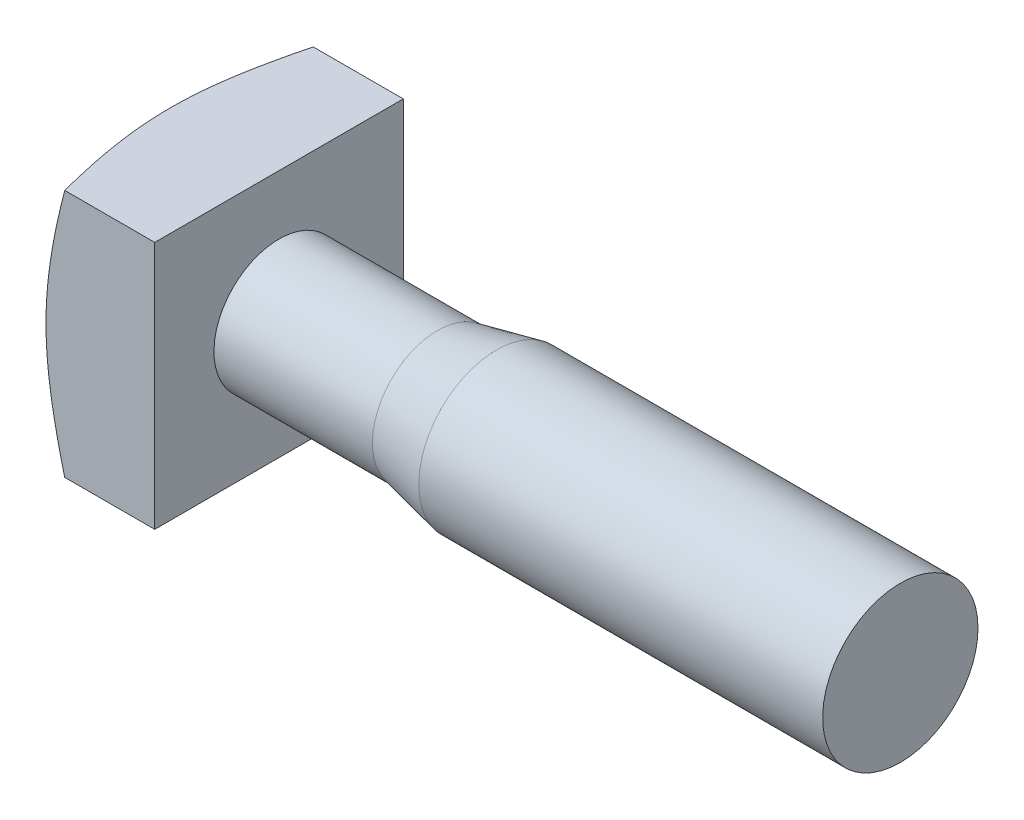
ISO-10303-21;
HEADER;
FILE_DESCRIPTION(('STEP AP214'),'2;1');
FILE_NAME('part.step','',(''),(''),'','','');
FILE_SCHEMA(('AUTOMOTIVE_DESIGN { 1 0 10303 214 1 1 1 1 }'));
ENDSEC;
DATA;
#1=APPLICATION_CONTEXT('core data for automotive mechanical design processes');
#2=APPLICATION_PROTOCOL_DEFINITION('international standard','automotive_design',2000,#1);
#3=PRODUCT_CONTEXT('',#1,'mechanical');
#4=PRODUCT('Part','Part','',(#3));
#5=PRODUCT_RELATED_PRODUCT_CATEGORY('part','',(#4));
#6=PRODUCT_DEFINITION_FORMATION('','',#4);
#7=PRODUCT_DEFINITION_CONTEXT('part definition',#1,'design');
#8=PRODUCT_DEFINITION('design','',#6,#7);
#9=PRODUCT_DEFINITION_SHAPE('','',#8);
#10=(LENGTH_UNIT() NAMED_UNIT(*) SI_UNIT(.MILLI.,.METRE.));
#11=(NAMED_UNIT(*) PLANE_ANGLE_UNIT() SI_UNIT($,.RADIAN.));
#12=(NAMED_UNIT(*) SI_UNIT($,.STERADIAN.) SOLID_ANGLE_UNIT());
#13=UNCERTAINTY_MEASURE_WITH_UNIT(LENGTH_MEASURE(1.E-05),#10,'distance_accuracy_value','');
#14=(GEOMETRIC_REPRESENTATION_CONTEXT(3) GLOBAL_UNCERTAINTY_ASSIGNED_CONTEXT((#13)) GLOBAL_UNIT_ASSIGNED_CONTEXT((#10,
#11,#12)) REPRESENTATION_CONTEXT('',''));
#15=CARTESIAN_POINT('',(0.,0.,0.));
#16=DIRECTION('',(0.,0.,1.));
#17=DIRECTION('',(1.,0.,0.));
#18=AXIS2_PLACEMENT_3D('',#15,#16,#17);
#19=CARTESIAN_POINT('',(7.,-8.,8.00000000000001));
#20=DIRECTION('',(1.,0.,0.));
#21=DIRECTION('',(0.,0.,-1.));
#22=AXIS2_PLACEMENT_3D('',#19,#20,#21);
#23=PLANE('',#22);
#24=DIRECTION('',(0.,-1.,0.));
#25=VECTOR('',#24,1.);
#26=CARTESIAN_POINT('',(7.,8.,8.00000000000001));
#27=LINE('',#26,#25);
#28=CARTESIAN_POINT('',(7.,8.,8.00000000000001));
#29=VERTEX_POINT('',#28);
#30=CARTESIAN_POINT('',(7.,-8.,8.00000000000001));
#31=VERTEX_POINT('',#30);
#32=EDGE_CURVE('E181',#29,#31,#27,.T.);
#33=ORIENTED_EDGE('',*,*,#32,.T.);
#34=DIRECTION('',(0.,0.,-1.));
#35=VECTOR('',#34,1.);
#36=CARTESIAN_POINT('',(7.,-8.,8.00000000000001));
#37=LINE('',#36,#35);
#38=CARTESIAN_POINT('',(7.,-7.99999999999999,-8.00000000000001));
#39=VERTEX_POINT('',#38);
#40=EDGE_CURVE('E184',#31,#39,#37,.T.);
#41=ORIENTED_EDGE('',*,*,#40,.T.);
#42=DIRECTION('',(0.,1.,0.));
#43=VECTOR('',#42,1.);
#44=CARTESIAN_POINT('',(7.,8.00000000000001,-8.));
#45=LINE('',#44,#43);
#46=CARTESIAN_POINT('',(7.,8.00000000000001,-8.));
#47=VERTEX_POINT('',#46);
#48=EDGE_CURVE('E186',#39,#47,#45,.T.);
#49=ORIENTED_EDGE('',*,*,#48,.T.);
#50=DIRECTION('',(0.,0.,1.));
#51=VECTOR('',#50,1.);
#52=CARTESIAN_POINT('',(7.,8.,8.00000000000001));
#53=LINE('',#52,#51);
#54=EDGE_CURVE('E121',#47,#29,#53,.T.);
#55=ORIENTED_EDGE('',*,*,#54,.T.);
#56=EDGE_LOOP('',(#33,#41,#49,#55));
#57=FACE_BOUND('',#56,.T.);
#58=CARTESIAN_POINT('',(7.,0.,0.));
#59=DIRECTION('',(-1.,0.,0.));
#60=DIRECTION('',(0.,-1.,0.));
#61=AXIS2_PLACEMENT_3D('',#58,#59,#60);
#62=CIRCLE('',#61,4.18800000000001);
#63=CARTESIAN_POINT('',(7.,-4.188,0.));
#64=VERTEX_POINT('',#63);
#65=EDGE_CURVE('E300',#64,#64,#62,.T.);
#66=ORIENTED_EDGE('',*,*,#65,.T.);
#67=EDGE_LOOP('',(#66));
#68=FACE_BOUND('',#67,.T.);
#69=ADVANCED_FACE('F43',(#57,#68),#23,.T.);
#70=CARTESIAN_POINT('',(7.,8.,8.00000000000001));
#71=DIRECTION('',(0.,0.,-1.));
#72=DIRECTION('',(-1.,0.,0.));
#73=AXIS2_PLACEMENT_3D('',#70,#71,#72);
#74=PLANE('',#73);
#75=CARTESIAN_POINT('',(3.56376598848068,-15.891278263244,8.00000000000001));
#76=CARTESIAN_POINT('',(3.43024833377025,-15.4805095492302,8.00000000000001));
#77=CARTESIAN_POINT('',(3.29763705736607,-15.069443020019,8.00000000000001));
#78=CARTESIAN_POINT('',(3.03472551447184,-14.246558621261,8.00000000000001));
#79=CARTESIAN_POINT('',(2.9044253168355,-13.8347407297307,8.00000000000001));
#80=CARTESIAN_POINT('',(2.6466844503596,-13.0103574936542,8.00000000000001));
#81=CARTESIAN_POINT('',(2.51924285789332,-12.5977924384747,8.00000000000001));
#82=CARTESIAN_POINT('',(2.26786813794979,-11.7715951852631,8.00000000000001));
#83=CARTESIAN_POINT('',(2.14393498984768,-11.3579629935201,8.00000000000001));
#84=CARTESIAN_POINT('',(1.90156103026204,-10.5330920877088,8.00000000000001));
#85=CARTESIAN_POINT('',(1.78308111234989,-10.1218648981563,8.00000000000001));
#86=CARTESIAN_POINT('',(1.55161025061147,-9.29785965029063,8.00000000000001));
#87=CARTESIAN_POINT('',(1.4386193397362,-8.88508158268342,8.00000000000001));
#88=CARTESIAN_POINT('',(1.21955399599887,-8.05724557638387,8.00000000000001));
#89=CARTESIAN_POINT('',(1.11348653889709,-7.64218578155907,8.00000000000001));
#90=CARTESIAN_POINT('',(0.910418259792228,-6.80983428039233,8.00000000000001));
#91=CARTESIAN_POINT('',(0.813417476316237,-6.39254256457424,8.00000000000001));
#92=CARTESIAN_POINT('',(0.634044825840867,-5.5688726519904,8.00000000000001));
#93=CARTESIAN_POINT('',(0.551302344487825,-5.1625759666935,8.00000000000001));
#94=CARTESIAN_POINT('',(0.399704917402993,-4.34736441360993,8.00000000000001));
#95=CARTESIAN_POINT('',(0.330849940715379,-3.93844955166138,8.00000000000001));
#96=CARTESIAN_POINT('',(0.210494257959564,-3.11893988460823,8.00000000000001));
#97=CARTESIAN_POINT('',(0.158955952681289,-2.70835070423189,8.00000000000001));
#98=CARTESIAN_POINT('',(0.0762837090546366,-1.88510388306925,8.00000000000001));
#99=CARTESIAN_POINT('',(0.0451483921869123,-1.47244638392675,8.00000000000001));
#100=CARTESIAN_POINT('',(0.00554317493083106,-0.643249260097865,8.00000000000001));
#101=CARTESIAN_POINT('',(-0.00277386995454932,-0.226702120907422,8.00000000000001));
#102=CARTESIAN_POINT('',(0.00441153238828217,0.606178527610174,8.00000000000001));
#103=CARTESIAN_POINT('',(0.0199140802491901,1.02251203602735,8.00000000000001));
#104=CARTESIAN_POINT('',(0.0734837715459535,1.85452132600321,8.00000000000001));
#105=CARTESIAN_POINT('',(0.111595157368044,2.27019421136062,8.00000000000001));
#106=CARTESIAN_POINT('',(0.183578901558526,2.89192416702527,8.00000000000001));
#107=CARTESIAN_POINT('',(0.210044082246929,3.09887794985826,8.00000000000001));
#108=CARTESIAN_POINT('',(0.267489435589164,3.51215667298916,8.00000000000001));
#109=CARTESIAN_POINT('',(0.298469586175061,3.71848161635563,8.00000000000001));
#110=CARTESIAN_POINT('',(0.428429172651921,4.52929851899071,8.00000000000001));
#111=CARTESIAN_POINT('',(0.542940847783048,5.13133310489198,8.00000000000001));
#112=CARTESIAN_POINT('',(0.733500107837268,6.03032508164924,8.00000000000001));
#113=CARTESIAN_POINT('',(0.800167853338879,6.32937502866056,8.00000000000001));
#114=CARTESIAN_POINT('',(0.938763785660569,6.92625756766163,8.00000000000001));
#115=CARTESIAN_POINT('',(1.01069185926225,7.22409018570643,8.00000000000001));
#116=CARTESIAN_POINT('',(1.15901277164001,7.81901260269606,8.00000000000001));
#117=CARTESIAN_POINT('',(1.23541086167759,8.11610108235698,8.00000000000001));
#118=CARTESIAN_POINT('',(1.39187536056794,8.70931252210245,8.00000000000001));
#119=CARTESIAN_POINT('',(1.47194181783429,9.00543546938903,8.00000000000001));
#120=CARTESIAN_POINT('',(1.71669014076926,9.89244184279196,8.00000000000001));
#121=CARTESIAN_POINT('',(1.88594624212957,10.482062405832,8.00000000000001));
#122=CARTESIAN_POINT('',(2.2338625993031,11.6613841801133,8.00000000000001));
#123=CARTESIAN_POINT('',(2.41256174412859,12.2510738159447,8.00000000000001));
#124=CARTESIAN_POINT('',(2.77629092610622,13.4285095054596,8.00000000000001));
#125=CARTESIAN_POINT('',(2.96132113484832,14.0162555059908,8.00000000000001));
#126=CARTESIAN_POINT('',(3.33593747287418,15.1898218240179,8.00000000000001));
#127=CARTESIAN_POINT('',(3.52552021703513,15.7756432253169,8.00000000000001));
#128=CARTESIAN_POINT('',(3.90823682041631,16.9461167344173,8.00000000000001));
#129=CARTESIAN_POINT('',(4.1013706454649,17.5307688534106,8.00000000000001));
#130=CARTESIAN_POINT('',(4.4890162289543,18.695050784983,8.00000000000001));
#131=CARTESIAN_POINT('',(4.6835087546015,19.2746870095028,8.00000000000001));
#132=CARTESIAN_POINT('',(5.07463191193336,20.4332380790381,8.00000000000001));
#133=CARTESIAN_POINT('',(5.27126254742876,21.0121529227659,8.00000000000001));
#134=CARTESIAN_POINT('',(5.86378383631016,22.7482864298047,8.00000000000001));
#135=CARTESIAN_POINT('',(6.26221774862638,23.9046368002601,8.00000000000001));
#136=CARTESIAN_POINT('',(7.05987917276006,26.2051158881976,8.00000000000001));
#137=CARTESIAN_POINT('',(7.45906545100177,27.3492589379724,8.00000000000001));
#138=CARTESIAN_POINT('',(8.06012955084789,29.0645171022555,8.00000000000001));
#139=CARTESIAN_POINT('',(8.26084064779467,29.6360414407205,8.00000000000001));
#140=CARTESIAN_POINT('',(8.66292988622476,30.7788547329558,8.00000000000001));
#141=CARTESIAN_POINT('',(8.8643080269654,31.3501436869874,8.00000000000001));
#142=CARTESIAN_POINT('',(9.0659647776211,31.9213342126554,8.00000000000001));
#143=B_SPLINE_CURVE_WITH_KNOTS('',3,(#75,#76,#77,#78,#79,#80,#81,#82,#83,#84,#85,#86,#87,#88,
#89,#90,#91,#92,#93,#94,#95,#96,#97,#98,#99,#100,#101,#102,#103,#104,#105,#106,#107,#108,#109,
#110,#111,#112,#113,#114,#115,#116,#117,#118,#119,#120,#121,#122,#123,#124,#125,#126,#127,#128,
#129,#130,#131,#132,#133,#134,#135,#136,#137,#138,#139,#140,#141,#142),.UNSPECIFIED.,.F.,.F.,(4,
2,2,2,2,2,2,2,2,2,2,2,2,2,2,2,2,2,2,2,2,2,2,2,2,2,2,2,2,2,2,2,2,4),(0.,1.29577397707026,
2.59158649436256,3.88697411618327,5.18235412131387,6.46618892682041,7.75003143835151,
9.03514813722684,10.3202702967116,11.5639904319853,12.8077077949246,14.0487069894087,
15.2896223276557,16.5388302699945,17.7880434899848,19.0397093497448,19.665584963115,
20.2914575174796,22.1289928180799,23.0481480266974,23.9672834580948,24.8875212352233,
25.8077711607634,27.6479627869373,29.4964347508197,31.3449568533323,33.1921445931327,
35.0393145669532,36.8734984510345,38.7076856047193,42.3768738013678,46.0122111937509,
47.8294409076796,49.6466685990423),.UNSPECIFIED.);
#144=CARTESIAN_POINT('',(1.20609125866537,-8.,8.00000000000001));
#145=VERTEX_POINT('',#144);
#146=CARTESIAN_POINT('',(0.,0.,8.));
#147=VERTEX_POINT('',#146);
#148=EDGE_CURVE('E60',#145,#147,#143,.T.);
#149=ORIENTED_EDGE('',*,*,#148,.F.);
#150=DIRECTION('',(-1.,0.,0.));
#151=VECTOR('',#150,1.);
#152=CARTESIAN_POINT('',(7.,-8.,8.00000000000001));
#153=LINE('',#152,#151);
#154=EDGE_CURVE('E125',#31,#145,#153,.T.);
#155=ORIENTED_EDGE('',*,*,#154,.F.);
#156=ORIENTED_EDGE('',*,*,#32,.F.);
#157=DIRECTION('',(-1.,0.,0.));
#158=VECTOR('',#157,1.);
#159=CARTESIAN_POINT('',(7.,8.,8.00000000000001));
#160=LINE('',#159,#158);
#161=CARTESIAN_POINT('',(1.20609125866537,8.,8.));
#162=VERTEX_POINT('',#161);
#163=EDGE_CURVE('E123',#29,#162,#160,.T.);
#164=ORIENTED_EDGE('',*,*,#163,.T.);
#165=EDGE_CURVE('E117',#147,#162,#143,.T.);
#166=ORIENTED_EDGE('',*,*,#165,.F.);
#167=EDGE_LOOP('',(#149,#155,#156,#164,#166));
#168=FACE_BOUND('',#167,.T.);
#169=ADVANCED_FACE('F45',(#168),#74,.F.);
#170=CARTESIAN_POINT('',(7.,-8.,8.00000000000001));
#171=DIRECTION('',(0.,1.,0.));
#172=DIRECTION('',(0.,0.,1.));
#173=AXIS2_PLACEMENT_3D('',#170,#171,#172);
#174=PLANE('',#173);
#175=CARTESIAN_POINT('',(3.56376598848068,-7.99999999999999,-15.891278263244));
#176=CARTESIAN_POINT('',(3.43024833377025,-7.99999999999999,-15.4805095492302));
#177=CARTESIAN_POINT('',(3.29763705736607,-7.99999999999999,-15.069443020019));
#178=CARTESIAN_POINT('',(3.03472551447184,-7.99999999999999,-14.246558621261));
#179=CARTESIAN_POINT('',(2.9044253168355,-7.99999999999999,-13.8347407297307));
#180=CARTESIAN_POINT('',(2.6466844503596,-7.99999999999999,-13.0103574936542));
#181=CARTESIAN_POINT('',(2.51924285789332,-7.99999999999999,-12.5977924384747));
#182=CARTESIAN_POINT('',(2.26786813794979,-7.99999999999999,-11.7715951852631));
#183=CARTESIAN_POINT('',(2.14393498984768,-7.99999999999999,-11.3579629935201));
#184=CARTESIAN_POINT('',(1.90156103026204,-7.99999999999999,-10.5330920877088));
#185=CARTESIAN_POINT('',(1.78308111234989,-7.99999999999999,-10.1218648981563));
#186=CARTESIAN_POINT('',(1.55161025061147,-7.99999999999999,-9.29785965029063));
#187=CARTESIAN_POINT('',(1.4386193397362,-7.99999999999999,-8.88508158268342));
#188=CARTESIAN_POINT('',(1.21955399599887,-7.99999999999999,-8.05724557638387));
#189=CARTESIAN_POINT('',(1.11348653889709,-7.99999999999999,-7.64218578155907));
#190=CARTESIAN_POINT('',(0.910418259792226,-7.99999999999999,-6.80983428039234));
#191=CARTESIAN_POINT('',(0.813417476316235,-7.99999999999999,-6.39254256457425));
#192=CARTESIAN_POINT('',(0.634044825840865,-7.99999999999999,-5.5688726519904));
#193=CARTESIAN_POINT('',(0.551302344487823,-7.99999999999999,-5.16257596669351));
#194=CARTESIAN_POINT('',(0.39970491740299,-7.99999999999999,-4.34736441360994));
#195=CARTESIAN_POINT('',(0.330849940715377,-7.99999999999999,-3.93844955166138));
#196=CARTESIAN_POINT('',(0.210494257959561,-7.99999999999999,-3.11893988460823));
#197=CARTESIAN_POINT('',(0.158955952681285,-7.99999999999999,-2.70835070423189));
#198=CARTESIAN_POINT('',(0.0762837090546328,-7.99999999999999,-1.88510388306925));
#199=CARTESIAN_POINT('',(0.0451483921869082,-8.,-1.47244638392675));
#200=CARTESIAN_POINT('',(0.00554317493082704,-8.,-0.643249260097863));
#201=CARTESIAN_POINT('',(-0.0027738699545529,-8.,-0.226702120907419));
#202=CARTESIAN_POINT('',(0.00441153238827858,-8.,0.606178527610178));
#203=CARTESIAN_POINT('',(0.019914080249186,-8.,1.02251203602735));
#204=CARTESIAN_POINT('',(0.0734837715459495,-8.,1.85452132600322));
#205=CARTESIAN_POINT('',(0.111595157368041,-8.,2.27019421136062));
#206=CARTESIAN_POINT('',(0.183578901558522,-8.,2.89192416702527));
#207=CARTESIAN_POINT('',(0.210044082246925,-8.,3.09887794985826));
#208=CARTESIAN_POINT('',(0.26748943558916,-8.,3.51215667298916));
#209=CARTESIAN_POINT('',(0.298469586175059,-8.,3.71848161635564));
#210=CARTESIAN_POINT('',(0.42842917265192,-8.,4.52929851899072));
#211=CARTESIAN_POINT('',(0.542940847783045,-8.,5.13133310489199));
#212=CARTESIAN_POINT('',(0.733500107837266,-8.,6.03032508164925));
#213=CARTESIAN_POINT('',(0.800167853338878,-8.,6.32937502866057));
#214=CARTESIAN_POINT('',(0.938763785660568,-8.,6.92625756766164));
#215=CARTESIAN_POINT('',(1.01069185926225,-8.,7.22409018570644));
#216=CARTESIAN_POINT('',(1.15901277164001,-8.,7.81901260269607));
#217=CARTESIAN_POINT('',(1.23541086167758,-8.,8.11610108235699));
#218=CARTESIAN_POINT('',(1.39187536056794,-8.,8.70931252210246));
#219=CARTESIAN_POINT('',(1.47194181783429,-8.,9.00543546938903));
#220=CARTESIAN_POINT('',(1.71669014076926,-8.,9.89244184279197));
#221=CARTESIAN_POINT('',(1.88594624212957,-8.,10.482062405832));
#222=CARTESIAN_POINT('',(2.2338625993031,-8.,11.6613841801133));
#223=CARTESIAN_POINT('',(2.41256174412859,-8.,12.2510738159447));
#224=CARTESIAN_POINT('',(2.77629092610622,-8.,13.4285095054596));
#225=CARTESIAN_POINT('',(2.96132113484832,-8.,14.0162555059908));
#226=CARTESIAN_POINT('',(3.33593747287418,-8.,15.1898218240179));
#227=CARTESIAN_POINT('',(3.52552021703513,-8.,15.7756432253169));
#228=CARTESIAN_POINT('',(3.90823682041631,-8.,16.9461167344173));
#229=CARTESIAN_POINT('',(4.1013706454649,-8.00000000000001,17.5307688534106));
#230=CARTESIAN_POINT('',(4.4890162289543,-8.00000000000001,18.695050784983));
#231=CARTESIAN_POINT('',(4.6835087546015,-8.00000000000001,19.2746870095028));
#232=CARTESIAN_POINT('',(5.07463191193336,-8.00000000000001,20.4332380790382));
#233=CARTESIAN_POINT('',(5.27126254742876,-8.00000000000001,21.0121529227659));
#234=CARTESIAN_POINT('',(5.86378383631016,-8.00000000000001,22.7482864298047));
#235=CARTESIAN_POINT('',(6.26221774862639,-8.00000000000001,23.9046368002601));
#236=CARTESIAN_POINT('',(7.05987917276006,-8.00000000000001,26.2051158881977));
#237=CARTESIAN_POINT('',(7.45906545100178,-8.00000000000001,27.3492589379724));
#238=CARTESIAN_POINT('',(8.06012955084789,-8.00000000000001,29.0645171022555));
#239=CARTESIAN_POINT('',(8.26084064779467,-8.00000000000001,29.6360414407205));
#240=CARTESIAN_POINT('',(8.66292988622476,-8.00000000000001,30.7788547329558));
#241=CARTESIAN_POINT('',(8.86430802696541,-8.00000000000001,31.3501436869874));
#242=CARTESIAN_POINT('',(9.06596477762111,-8.00000000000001,31.9213342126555));
#243=B_SPLINE_CURVE_WITH_KNOTS('',3,(#175,#176,#177,#178,#179,#180,#181,#182,#183,#184,#185,
#186,#187,#188,#189,#190,#191,#192,#193,#194,#195,#196,#197,#198,#199,#200,#201,#202,#203,#204,
#205,#206,#207,#208,#209,#210,#211,#212,#213,#214,#215,#216,#217,#218,#219,#220,#221,#222,#223,
#224,#225,#226,#227,#228,#229,#230,#231,#232,#233,#234,#235,#236,#237,#238,#239,#240,#241,#242),
.UNSPECIFIED.,.F.,.F.,(4,2,2,2,2,2,2,2,2,2,2,2,2,2,2,2,2,2,2,2,2,2,2,2,2,2,2,2,2,2,2,2,2,4),(0.,
1.29577397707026,2.59158649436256,3.88697411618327,5.18235412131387,6.46618892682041,
7.75003143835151,9.03514813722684,10.3202702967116,11.5639904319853,12.8077077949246,
14.0487069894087,15.2896223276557,16.5388302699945,17.7880434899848,19.0397093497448,
19.665584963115,20.2914575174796,22.12899281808,23.0481480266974,23.9672834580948,
24.8875212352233,25.8077711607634,27.6479627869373,29.4964347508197,31.3449568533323,
33.1921445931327,35.0393145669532,36.8734984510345,38.7076856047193,42.3768738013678,
46.0122111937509,47.8294409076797,49.6466685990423),.UNSPECIFIED.);
#244=CARTESIAN_POINT('',(1.20609125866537,-8.,-8.00000000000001));
#245=VERTEX_POINT('',#244);
#246=CARTESIAN_POINT('',(0.,-8.,0.));
#247=VERTEX_POINT('',#246);
#248=EDGE_CURVE('E138',#245,#247,#243,.T.);
#249=ORIENTED_EDGE('',*,*,#248,.F.);
#250=DIRECTION('',(-1.,0.,0.));
#251=VECTOR('',#250,1.);
#252=CARTESIAN_POINT('',(7.,-7.99999999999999,-8.00000000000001));
#253=LINE('',#252,#251);
#254=EDGE_CURVE('E122',#39,#245,#253,.T.);
#255=ORIENTED_EDGE('',*,*,#254,.F.);
#256=ORIENTED_EDGE('',*,*,#40,.F.);
#257=ORIENTED_EDGE('',*,*,#154,.T.);
#258=EDGE_CURVE('E171',#247,#145,#243,.T.);
#259=ORIENTED_EDGE('',*,*,#258,.F.);
#260=EDGE_LOOP('',(#249,#255,#256,#257,#259));
#261=FACE_BOUND('',#260,.T.);
#262=ADVANCED_FACE('F167',(#261),#174,.F.);
#263=CARTESIAN_POINT('',(7.,8.00000000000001,-8.));
#264=DIRECTION('',(0.,0.,1.));
#265=DIRECTION('',(0.,-1.,0.));
#266=AXIS2_PLACEMENT_3D('',#263,#264,#265);
#267=PLANE('',#266);
#268=CARTESIAN_POINT('',(3.56376598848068,-15.8912782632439,-8.00000000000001));
#269=CARTESIAN_POINT('',(3.43024833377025,-15.4805095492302,-8.00000000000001));
#270=CARTESIAN_POINT('',(3.29763705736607,-15.069443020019,-8.00000000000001));
#271=CARTESIAN_POINT('',(3.03472551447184,-14.246558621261,-8.00000000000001));
#272=CARTESIAN_POINT('',(2.9044253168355,-13.8347407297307,-8.00000000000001));
#273=CARTESIAN_POINT('',(2.6466844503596,-13.0103574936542,-8.00000000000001));
#274=CARTESIAN_POINT('',(2.51924285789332,-12.5977924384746,-8.00000000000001));
#275=CARTESIAN_POINT('',(2.26786813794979,-11.7715951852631,-8.00000000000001));
#276=CARTESIAN_POINT('',(2.14393498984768,-11.3579629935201,-8.00000000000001));
#277=CARTESIAN_POINT('',(1.90156103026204,-10.5330920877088,-8.00000000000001));
#278=CARTESIAN_POINT('',(1.78308111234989,-10.1218648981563,-8.00000000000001));
#279=CARTESIAN_POINT('',(1.55161025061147,-9.29785965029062,-8.00000000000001));
#280=CARTESIAN_POINT('',(1.4386193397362,-8.88508158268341,-8.00000000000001));
#281=CARTESIAN_POINT('',(1.21955399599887,-8.05724557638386,-8.00000000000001));
#282=CARTESIAN_POINT('',(1.11348653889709,-7.64218578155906,-8.00000000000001));
#283=CARTESIAN_POINT('',(0.910418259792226,-6.80983428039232,-8.00000000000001));
#284=CARTESIAN_POINT('',(0.813417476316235,-6.39254256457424,-8.));
#285=CARTESIAN_POINT('',(0.634044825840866,-5.56887265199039,-8.));
#286=CARTESIAN_POINT('',(0.551302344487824,-5.1625759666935,-8.));
#287=CARTESIAN_POINT('',(0.399704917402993,-4.34736441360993,-8.));
#288=CARTESIAN_POINT('',(0.330849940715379,-3.93844955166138,-8.));
#289=CARTESIAN_POINT('',(0.210494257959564,-3.11893988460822,-8.));
#290=CARTESIAN_POINT('',(0.158955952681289,-2.70835070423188,-8.));
#291=CARTESIAN_POINT('',(0.0762837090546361,-1.88510388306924,-8.));
#292=CARTESIAN_POINT('',(0.0451483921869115,-1.47244638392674,-8.));
#293=CARTESIAN_POINT('',(0.00554317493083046,-0.64324926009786,-8.));
#294=CARTESIAN_POINT('',(-0.00277386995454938,-0.226702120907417,-8.));
#295=CARTESIAN_POINT('',(0.00441153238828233,0.60617852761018,-8.));
#296=CARTESIAN_POINT('',(0.0199140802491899,1.02251203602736,-8.));
#297=CARTESIAN_POINT('',(0.0734837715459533,1.85452132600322,-8.));
#298=CARTESIAN_POINT('',(0.111595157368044,2.27019421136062,-8.));
#299=CARTESIAN_POINT('',(0.183578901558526,2.89192416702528,-8.));
#300=CARTESIAN_POINT('',(0.210044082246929,3.09887794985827,-8.));
#301=CARTESIAN_POINT('',(0.267489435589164,3.51215667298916,-8.));
#302=CARTESIAN_POINT('',(0.298469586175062,3.71848161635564,-8.));
#303=CARTESIAN_POINT('',(0.428429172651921,4.52929851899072,-8.));
#304=CARTESIAN_POINT('',(0.542940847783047,5.13133310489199,-8.));
#305=CARTESIAN_POINT('',(0.733500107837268,6.03032508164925,-8.));
#306=CARTESIAN_POINT('',(0.80016785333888,6.32937502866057,-8.));
#307=CARTESIAN_POINT('',(0.938763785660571,6.92625756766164,-8.));
#308=CARTESIAN_POINT('',(1.01069185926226,7.22409018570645,-8.));
#309=CARTESIAN_POINT('',(1.15901277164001,7.81901260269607,-8.));
#310=CARTESIAN_POINT('',(1.23541086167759,8.11610108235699,-8.));
#311=CARTESIAN_POINT('',(1.39187536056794,8.70931252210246,-8.));
#312=CARTESIAN_POINT('',(1.47194181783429,9.00543546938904,-8.));
#313=CARTESIAN_POINT('',(1.71669014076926,9.89244184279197,-8.));
#314=CARTESIAN_POINT('',(1.88594624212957,10.4820624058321,-8.));
#315=CARTESIAN_POINT('',(2.2338625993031,11.6613841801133,-8.));
#316=CARTESIAN_POINT('',(2.4125617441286,12.2510738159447,-8.));
#317=CARTESIAN_POINT('',(2.77629092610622,13.4285095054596,-8.));
#318=CARTESIAN_POINT('',(2.96132113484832,14.0162555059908,-7.99999999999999));
#319=CARTESIAN_POINT('',(3.33593747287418,15.1898218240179,-7.99999999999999));
#320=CARTESIAN_POINT('',(3.52552021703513,15.7756432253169,-7.99999999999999));
#321=CARTESIAN_POINT('',(3.90823682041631,16.9461167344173,-7.99999999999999));
#322=CARTESIAN_POINT('',(4.10137064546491,17.5307688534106,-7.99999999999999));
#323=CARTESIAN_POINT('',(4.4890162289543,18.695050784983,-7.99999999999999));
#324=CARTESIAN_POINT('',(4.68350875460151,19.2746870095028,-7.99999999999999));
#325=CARTESIAN_POINT('',(5.07463191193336,20.4332380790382,-7.99999999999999));
#326=CARTESIAN_POINT('',(5.27126254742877,21.0121529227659,-7.99999999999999));
#327=CARTESIAN_POINT('',(5.86378383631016,22.7482864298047,-7.99999999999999));
#328=CARTESIAN_POINT('',(6.26221774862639,23.9046368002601,-7.99999999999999));
#329=CARTESIAN_POINT('',(7.05987917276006,26.2051158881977,-7.99999999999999));
#330=CARTESIAN_POINT('',(7.45906545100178,27.3492589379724,-7.99999999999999));
#331=CARTESIAN_POINT('',(8.06012955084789,29.0645171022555,-7.99999999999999));
#332=CARTESIAN_POINT('',(8.26084064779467,29.6360414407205,-7.99999999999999));
#333=CARTESIAN_POINT('',(8.66292988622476,30.7788547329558,-7.99999999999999));
#334=CARTESIAN_POINT('',(8.8643080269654,31.3501436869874,-7.99999999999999));
#335=CARTESIAN_POINT('',(9.0659647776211,31.9213342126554,-7.99999999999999));
#336=B_SPLINE_CURVE_WITH_KNOTS('',3,(#268,#269,#270,#271,#272,#273,#274,#275,#276,#277,#278,
#279,#280,#281,#282,#283,#284,#285,#286,#287,#288,#289,#290,#291,#292,#293,#294,#295,#296,#297,
#298,#299,#300,#301,#302,#303,#304,#305,#306,#307,#308,#309,#310,#311,#312,#313,#314,#315,#316,
#317,#318,#319,#320,#321,#322,#323,#324,#325,#326,#327,#328,#329,#330,#331,#332,#333,#334,#335),
.UNSPECIFIED.,.F.,.F.,(4,2,2,2,2,2,2,2,2,2,2,2,2,2,2,2,2,2,2,2,2,2,2,2,2,2,2,2,2,2,2,2,2,4),(0.,
1.29577397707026,2.59158649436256,3.88697411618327,5.18235412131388,6.46618892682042,
7.75003143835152,9.03514813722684,10.3202702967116,11.5639904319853,12.8077077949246,
14.0487069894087,15.2896223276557,16.5388302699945,17.7880434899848,19.0397093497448,
19.665584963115,20.2914575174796,22.12899281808,23.0481480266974,23.9672834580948,
24.8875212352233,25.8077711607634,27.6479627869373,29.4964347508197,31.3449568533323,
33.1921445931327,35.0393145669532,36.8734984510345,38.7076856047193,42.3768738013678,
46.0122111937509,47.8294409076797,49.6466685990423),.UNSPECIFIED.);
#337=CARTESIAN_POINT('',(1.20609125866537,8.00000000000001,-7.99999999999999));
#338=VERTEX_POINT('',#337);
#339=CARTESIAN_POINT('',(0.,0.,-8.));
#340=VERTEX_POINT('',#339);
#341=EDGE_CURVE('E98',#338,#340,#336,.F.);
#342=ORIENTED_EDGE('',*,*,#341,.F.);
#343=DIRECTION('',(-1.,0.,0.));
#344=VECTOR('',#343,1.);
#345=CARTESIAN_POINT('',(7.,8.00000000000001,-8.));
#346=LINE('',#345,#344);
#347=EDGE_CURVE('E113',#47,#338,#346,.T.);
#348=ORIENTED_EDGE('',*,*,#347,.F.);
#349=ORIENTED_EDGE('',*,*,#48,.F.);
#350=ORIENTED_EDGE('',*,*,#254,.T.);
#351=EDGE_CURVE('E116',#340,#245,#336,.F.);
#352=ORIENTED_EDGE('',*,*,#351,.F.);
#353=EDGE_LOOP('',(#342,#348,#349,#350,#352));
#354=FACE_BOUND('',#353,.T.);
#355=ADVANCED_FACE('F111',(#354),#267,.F.);
#356=CARTESIAN_POINT('',(7.,8.,8.00000000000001));
#357=DIRECTION('',(0.,-1.,0.));
#358=DIRECTION('',(0.,0.,-1.));
#359=AXIS2_PLACEMENT_3D('',#356,#357,#358);
#360=PLANE('',#359);
#361=CARTESIAN_POINT('',(3.56376598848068,8.00000000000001,-15.891278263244));
#362=CARTESIAN_POINT('',(3.43024833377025,8.00000000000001,-15.4805095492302));
#363=CARTESIAN_POINT('',(3.29763705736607,8.00000000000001,-15.069443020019));
#364=CARTESIAN_POINT('',(3.03472551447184,8.00000000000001,-14.246558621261));
#365=CARTESIAN_POINT('',(2.9044253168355,8.00000000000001,-13.8347407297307));
#366=CARTESIAN_POINT('',(2.6466844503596,8.00000000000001,-13.0103574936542));
#367=CARTESIAN_POINT('',(2.51924285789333,8.00000000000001,-12.5977924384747));
#368=CARTESIAN_POINT('',(2.26786813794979,8.00000000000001,-11.7715951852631));
#369=CARTESIAN_POINT('',(2.14393498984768,8.00000000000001,-11.3579629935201));
#370=CARTESIAN_POINT('',(1.90156103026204,8.00000000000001,-10.5330920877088));
#371=CARTESIAN_POINT('',(1.7830811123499,8.00000000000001,-10.1218648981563));
#372=CARTESIAN_POINT('',(1.55161025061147,8.00000000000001,-9.29785965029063));
#373=CARTESIAN_POINT('',(1.4386193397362,8.00000000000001,-8.88508158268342));
#374=CARTESIAN_POINT('',(1.21955399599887,8.00000000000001,-8.05724557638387));
#375=CARTESIAN_POINT('',(1.1134865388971,8.00000000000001,-7.64218578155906));
#376=CARTESIAN_POINT('',(0.91041825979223,8.00000000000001,-6.80983428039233));
#377=CARTESIAN_POINT('',(0.813417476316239,8.00000000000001,-6.39254256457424));
#378=CARTESIAN_POINT('',(0.634044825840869,8.00000000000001,-5.5688726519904));
#379=CARTESIAN_POINT('',(0.551302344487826,8.00000000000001,-5.1625759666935));
#380=CARTESIAN_POINT('',(0.399704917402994,8.00000000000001,-4.34736441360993));
#381=CARTESIAN_POINT('',(0.330849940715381,8.00000000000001,-3.93844955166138));
#382=CARTESIAN_POINT('',(0.210494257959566,8.00000000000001,-3.11893988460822));
#383=CARTESIAN_POINT('',(0.15895595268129,8.00000000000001,-2.70835070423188));
#384=CARTESIAN_POINT('',(0.0762837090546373,8.00000000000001,-1.88510388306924));
#385=CARTESIAN_POINT('',(0.045148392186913,8.,-1.47244638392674));
#386=CARTESIAN_POINT('',(0.00554317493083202,8.,-0.643249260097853));
#387=CARTESIAN_POINT('',(-0.00277386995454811,8.,-0.22670212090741));
#388=CARTESIAN_POINT('',(0.00441153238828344,8.,0.606178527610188));
#389=CARTESIAN_POINT('',(0.0199140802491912,8.,1.02251203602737));
#390=CARTESIAN_POINT('',(0.0734837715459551,8.,1.85452132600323));
#391=CARTESIAN_POINT('',(0.111595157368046,8.,2.27019421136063));
#392=CARTESIAN_POINT('',(0.183578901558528,8.,2.89192416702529));
#393=CARTESIAN_POINT('',(0.21004408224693,8.,3.09887794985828));
#394=CARTESIAN_POINT('',(0.267489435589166,8.,3.51215667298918));
#395=CARTESIAN_POINT('',(0.298469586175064,8.,3.71848161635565));
#396=CARTESIAN_POINT('',(0.428429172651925,8.,4.52929851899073));
#397=CARTESIAN_POINT('',(0.542940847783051,8.,5.131333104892));
#398=CARTESIAN_POINT('',(0.733500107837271,8.,6.03032508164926));
#399=CARTESIAN_POINT('',(0.800167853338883,8.,6.32937502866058));
#400=CARTESIAN_POINT('',(0.938763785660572,8.,6.92625756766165));
#401=CARTESIAN_POINT('',(1.01069185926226,8.,7.22409018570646));
#402=CARTESIAN_POINT('',(1.15901277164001,8.,7.81901260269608));
#403=CARTESIAN_POINT('',(1.23541086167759,8.,8.11610108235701));
#404=CARTESIAN_POINT('',(1.39187536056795,8.,8.70931252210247));
#405=CARTESIAN_POINT('',(1.47194181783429,8.,9.00543546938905));
#406=CARTESIAN_POINT('',(1.71669014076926,8.,9.89244184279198));
#407=CARTESIAN_POINT('',(1.88594624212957,8.,10.4820624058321));
#408=CARTESIAN_POINT('',(2.2338625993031,8.,11.6613841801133));
#409=CARTESIAN_POINT('',(2.4125617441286,8.,12.2510738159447));
#410=CARTESIAN_POINT('',(2.77629092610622,8.,13.4285095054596));
#411=CARTESIAN_POINT('',(2.96132113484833,8.,14.0162555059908));
#412=CARTESIAN_POINT('',(3.33593747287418,8.,15.1898218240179));
#413=CARTESIAN_POINT('',(3.52552021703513,8.,15.7756432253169));
#414=CARTESIAN_POINT('',(3.90823682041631,8.,16.9461167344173));
#415=CARTESIAN_POINT('',(4.10137064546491,7.99999999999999,17.5307688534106));
#416=CARTESIAN_POINT('',(4.48901622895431,7.99999999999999,18.695050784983));
#417=CARTESIAN_POINT('',(4.68350875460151,7.99999999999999,19.2746870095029));
#418=CARTESIAN_POINT('',(5.07463191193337,7.99999999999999,20.4332380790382));
#419=CARTESIAN_POINT('',(5.27126254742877,7.99999999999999,21.0121529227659));
#420=CARTESIAN_POINT('',(5.86378383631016,7.99999999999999,22.7482864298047));
#421=CARTESIAN_POINT('',(6.26221774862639,7.99999999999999,23.9046368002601));
#422=CARTESIAN_POINT('',(7.05987917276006,7.99999999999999,26.2051158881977));
#423=CARTESIAN_POINT('',(7.45906545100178,7.99999999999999,27.3492589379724));
#424=CARTESIAN_POINT('',(8.06012955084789,7.99999999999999,29.0645171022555));
#425=CARTESIAN_POINT('',(8.26084064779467,7.99999999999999,29.6360414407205));
#426=CARTESIAN_POINT('',(8.66292988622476,7.99999999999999,30.7788547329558));
#427=CARTESIAN_POINT('',(8.86430802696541,7.99999999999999,31.3501436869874));
#428=CARTESIAN_POINT('',(9.06596477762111,7.99999999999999,31.9213342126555));
#429=B_SPLINE_CURVE_WITH_KNOTS('',3,(#361,#362,#363,#364,#365,#366,#367,#368,#369,#370,#371,
#372,#373,#374,#375,#376,#377,#378,#379,#380,#381,#382,#383,#384,#385,#386,#387,#388,#389,#390,
#391,#392,#393,#394,#395,#396,#397,#398,#399,#400,#401,#402,#403,#404,#405,#406,#407,#408,#409,
#410,#411,#412,#413,#414,#415,#416,#417,#418,#419,#420,#421,#422,#423,#424,#425,#426,#427,#428),
.UNSPECIFIED.,.F.,.F.,(4,2,2,2,2,2,2,2,2,2,2,2,2,2,2,2,2,2,2,2,2,2,2,2,2,2,2,2,2,2,2,2,2,4),(0.,
1.29577397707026,2.59158649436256,3.88697411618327,5.18235412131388,6.46618892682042,
7.75003143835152,9.03514813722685,10.3202702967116,11.5639904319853,12.8077077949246,
14.0487069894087,15.2896223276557,16.5388302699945,17.7880434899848,19.0397093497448,
19.6655849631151,20.2914575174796,22.12899281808,23.0481480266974,23.9672834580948,
24.8875212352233,25.8077711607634,27.6479627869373,29.4964347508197,31.3449568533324,
33.1921445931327,35.0393145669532,36.8734984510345,38.7076856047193,42.3768738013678,
46.0122111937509,47.8294409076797,49.6466685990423),.UNSPECIFIED.);
#430=CARTESIAN_POINT('',(0.,8.,0.));
#431=VERTEX_POINT('',#430);
#432=EDGE_CURVE('E106',#162,#431,#429,.F.);
#433=ORIENTED_EDGE('',*,*,#432,.F.);
#434=ORIENTED_EDGE('',*,*,#163,.F.);
#435=ORIENTED_EDGE('',*,*,#54,.F.);
#436=ORIENTED_EDGE('',*,*,#347,.T.);
#437=EDGE_CURVE('E95',#431,#338,#429,.F.);
#438=ORIENTED_EDGE('',*,*,#437,.F.);
#439=EDGE_LOOP('',(#433,#434,#435,#436,#438));
#440=FACE_BOUND('',#439,.T.);
#441=ADVANCED_FACE('F119',(#440),#360,.F.);
#442=CARTESIAN_POINT('',(1.20609125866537,0.,0.));
#443=DIRECTION('',(1.,0.,0.));
#444=DIRECTION('',(0.,0.,-1.));
#445=AXIS2_PLACEMENT_3D('',#442,#443,#444);
#446=CONICAL_SURFACE('',#445,11.3137084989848,1.22173047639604);
#447=ORIENTED_EDGE('',*,*,#248,.T.);
#448=CARTESIAN_POINT('',(0.,0.,0.));
#449=DIRECTION('',(1.,0.,0.));
#450=DIRECTION('',(0.,0.,-1.));
#451=AXIS2_PLACEMENT_3D('',#448,#449,#450);
#452=CIRCLE('',#451,8.);
#453=EDGE_CURVE('E48',#247,#340,#452,.T.);
#454=ORIENTED_EDGE('',*,*,#453,.T.);
#455=ORIENTED_EDGE('',*,*,#351,.T.);
#456=EDGE_LOOP('',(#447,#454,#455));
#457=FACE_BOUND('',#456,.T.);
#458=ADVANCED_FACE('F136',(#457),#446,.T.);
#459=ORIENTED_EDGE('',*,*,#258,.T.);
#460=ORIENTED_EDGE('',*,*,#148,.T.);
#461=EDGE_CURVE('E53',#147,#247,#452,.T.);
#462=ORIENTED_EDGE('',*,*,#461,.T.);
#463=EDGE_LOOP('',(#459,#460,#462));
#464=FACE_BOUND('',#463,.T.);
#465=ADVANCED_FACE('F195',(#464),#446,.T.);
#466=ORIENTED_EDGE('',*,*,#165,.T.);
#467=ORIENTED_EDGE('',*,*,#432,.T.);
#468=EDGE_CURVE('E11',#431,#147,#452,.T.);
#469=ORIENTED_EDGE('',*,*,#468,.T.);
#470=EDGE_LOOP('',(#466,#467,#469));
#471=FACE_BOUND('',#470,.T.);
#472=ADVANCED_FACE('F193',(#471),#446,.T.);
#473=ORIENTED_EDGE('',*,*,#341,.T.);
#474=CARTESIAN_POINT('',(0.,0.,0.));
#475=DIRECTION('',(1.,0.,0.));
#476=DIRECTION('',(0.,0.,-1.));
#477=AXIS2_PLACEMENT_3D('',#474,#475,#476);
#478=CIRCLE('',#477,8.);
#479=EDGE_CURVE('E101',#340,#431,#478,.T.);
#480=ORIENTED_EDGE('',*,*,#479,.T.);
#481=ORIENTED_EDGE('',*,*,#437,.T.);
#482=EDGE_LOOP('',(#473,#480,#481));
#483=FACE_BOUND('',#482,.T.);
#484=ADVANCED_FACE('F97',(#483),#446,.T.);
#485=CARTESIAN_POINT('',(0.,-8.,8.00000000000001));
#486=DIRECTION('',(1.,0.,0.));
#487=DIRECTION('',(0.,0.,-1.));
#488=AXIS2_PLACEMENT_3D('',#485,#486,#487);
#489=PLANE('',#488);
#490=ORIENTED_EDGE('',*,*,#479,.F.);
#491=ORIENTED_EDGE('',*,*,#453,.F.);
#492=ORIENTED_EDGE('',*,*,#461,.F.);
#493=ORIENTED_EDGE('',*,*,#468,.F.);
#494=EDGE_LOOP('',(#490,#491,#492,#493));
#495=FACE_BOUND('',#494,.T.);
#496=ADVANCED_FACE('F140',(#495),#489,.F.);
#497=CARTESIAN_POINT('',(21.,0.,0.));
#498=DIRECTION('',(1.,0.,0.));
#499=DIRECTION('',(0.,1.,0.));
#500=AXIS2_PLACEMENT_3D('',#497,#498,#499);
#501=CONICAL_SURFACE('',#500,5.00000000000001,0.210518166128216);
#502=CARTESIAN_POINT('',(17.2,0.,0.));
#503=DIRECTION('',(-1.,0.,0.));
#504=DIRECTION('',(0.,-1.,0.));
#505=AXIS2_PLACEMENT_3D('',#502,#503,#504);
#506=CIRCLE('',#505,4.18800000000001);
#507=CARTESIAN_POINT('',(17.2,-4.188,0.));
#508=VERTEX_POINT('',#507);
#509=EDGE_CURVE('E303',#508,#508,#506,.T.);
#510=ORIENTED_EDGE('',*,*,#509,.F.);
#511=EDGE_LOOP('',(#510));
#512=FACE_BOUND('',#511,.T.);
#513=CARTESIAN_POINT('',(21.,0.,0.));
#514=DIRECTION('',(-1.,0.,0.));
#515=DIRECTION('',(0.,-1.,0.));
#516=AXIS2_PLACEMENT_3D('',#513,#514,#515);
#517=CIRCLE('',#516,5.00000000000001);
#518=CARTESIAN_POINT('',(21.,-5.,0.));
#519=VERTEX_POINT('',#518);
#520=EDGE_CURVE('E144',#519,#519,#517,.T.);
#521=ORIENTED_EDGE('',*,*,#520,.T.);
#522=EDGE_LOOP('',(#521));
#523=FACE_BOUND('',#522,.T.);
#524=ADVANCED_FACE('F282',(#512,#523),#501,.T.);
#525=CARTESIAN_POINT('',(-3.79094863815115,0.,0.));
#526=DIRECTION('',(-1.,0.,0.));
#527=DIRECTION('',(0.,-1.,0.));
#528=AXIS2_PLACEMENT_3D('',#525,#526,#527);
#529=CYLINDRICAL_SURFACE('',#528,4.18800000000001);
#530=ORIENTED_EDGE('',*,*,#65,.F.);
#531=EDGE_LOOP('',(#530));
#532=FACE_BOUND('',#531,.T.);
#533=ORIENTED_EDGE('',*,*,#509,.T.);
#534=EDGE_LOOP('',(#533));
#535=FACE_BOUND('',#534,.T.);
#536=ADVANCED_FACE('F271',(#532,#535),#529,.T.);
#537=CARTESIAN_POINT('',(47.,0.,0.));
#538=DIRECTION('',(1.,0.,0.));
#539=DIRECTION('',(0.,0.,-1.));
#540=AXIS2_PLACEMENT_3D('',#537,#538,#539);
#541=PLANE('',#540);
#542=CARTESIAN_POINT('',(47.,0.,0.));
#543=DIRECTION('',(1.,0.,0.));
#544=DIRECTION('',(0.,0.,-1.));
#545=AXIS2_PLACEMENT_3D('',#542,#543,#544);
#546=CIRCLE('',#545,5.);
#547=CARTESIAN_POINT('',(47.,0.,-5.));
#548=VERTEX_POINT('',#547);
#549=EDGE_CURVE('E141',#548,#548,#546,.T.);
#550=ORIENTED_EDGE('',*,*,#549,.T.);
#551=EDGE_LOOP('',(#550));
#552=FACE_BOUND('',#551,.T.);
#553=ADVANCED_FACE('F262',(#552),#541,.T.);
#554=CARTESIAN_POINT('',(47.,0.,0.));
#555=DIRECTION('',(-1.,0.,0.));
#556=DIRECTION('',(0.,0.,1.));
#557=AXIS2_PLACEMENT_3D('',#554,#555,#556);
#558=CYLINDRICAL_SURFACE('',#557,5.);
#559=ORIENTED_EDGE('',*,*,#520,.F.);
#560=EDGE_LOOP('',(#559));
#561=FACE_BOUND('',#560,.T.);
#562=ORIENTED_EDGE('',*,*,#549,.F.);
#563=EDGE_LOOP('',(#562));
#564=FACE_BOUND('',#563,.T.);
#565=ADVANCED_FACE('F256',(#561,#564),#558,.T.);
#566=CLOSED_SHELL('',(#69,#169,#262,#355,#441,#458,#465,#472,#484,#496,#524,#536,#553,#565));
#567=MANIFOLD_SOLID_BREP('B2',#566);
#568=ADVANCED_BREP_SHAPE_REPRESENTATION('',(#18,#567),#14);
#569=SHAPE_DEFINITION_REPRESENTATION(#9,#568);
ENDSEC;
END-ISO-10303-21;
